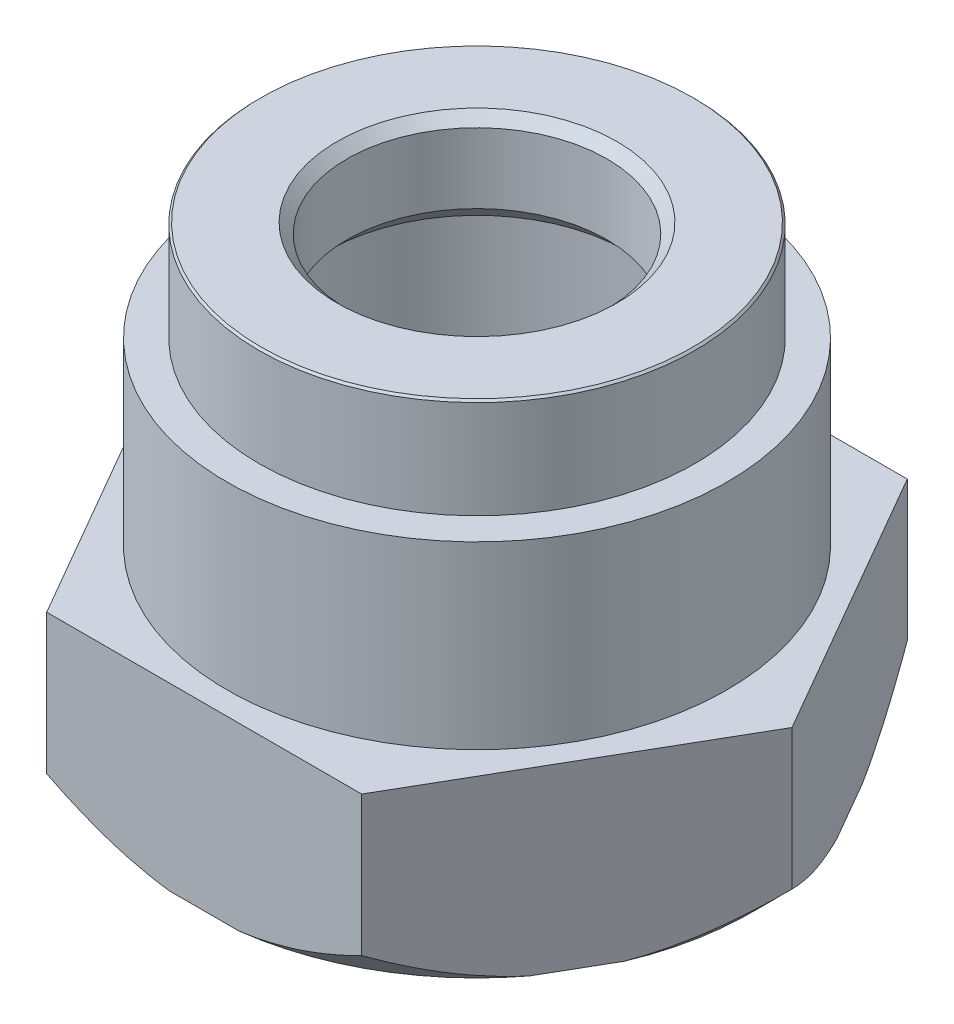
ISO-10303-21;
HEADER;
FILE_DESCRIPTION(('STEP AP214'),'2;1');
FILE_NAME('part.step','',(''),(''),'','','');
FILE_SCHEMA(('AUTOMOTIVE_DESIGN { 1 0 10303 214 1 1 1 1 }'));
ENDSEC;
DATA;
#1=APPLICATION_CONTEXT('core data for automotive mechanical design processes');
#2=APPLICATION_PROTOCOL_DEFINITION('international standard','automotive_design',2000,#1);
#3=PRODUCT_CONTEXT('',#1,'mechanical');
#4=PRODUCT('Part','Part','',(#3));
#5=PRODUCT_RELATED_PRODUCT_CATEGORY('part','',(#4));
#6=PRODUCT_DEFINITION_FORMATION('','',#4);
#7=PRODUCT_DEFINITION_CONTEXT('part definition',#1,'design');
#8=PRODUCT_DEFINITION('design','',#6,#7);
#9=PRODUCT_DEFINITION_SHAPE('','',#8);
#10=(LENGTH_UNIT() NAMED_UNIT(*) SI_UNIT(.MILLI.,.METRE.));
#11=(NAMED_UNIT(*) PLANE_ANGLE_UNIT() SI_UNIT($,.RADIAN.));
#12=(NAMED_UNIT(*) SI_UNIT($,.STERADIAN.) SOLID_ANGLE_UNIT());
#13=UNCERTAINTY_MEASURE_WITH_UNIT(LENGTH_MEASURE(1.E-05),#10,'distance_accuracy_value','');
#14=(GEOMETRIC_REPRESENTATION_CONTEXT(3) GLOBAL_UNCERTAINTY_ASSIGNED_CONTEXT((#13)) GLOBAL_UNIT_ASSIGNED_CONTEXT((#10,
#11,#12)) REPRESENTATION_CONTEXT('',''));
#15=CARTESIAN_POINT('',(0.,0.,0.));
#16=DIRECTION('',(0.,0.,1.));
#17=DIRECTION('',(1.,0.,0.));
#18=AXIS2_PLACEMENT_3D('',#15,#16,#17);
#19=CARTESIAN_POINT('',(15.75,0.,0.));
#20=DIRECTION('',(0.,-1.,0.));
#21=DIRECTION('',(0.,0.,-1.));
#22=AXIS2_PLACEMENT_3D('',#19,#20,#21);
#23=PLANE('',#22);
#24=CARTESIAN_POINT('',(0.,0.,0.));
#25=DIRECTION('',(0.,-1.,0.));
#26=DIRECTION('',(0.,0.,-1.));
#27=AXIS2_PLACEMENT_3D('',#24,#25,#26);
#28=CIRCLE('',#27,10.3155);
#29=CARTESIAN_POINT('',(0.,0.,-10.3155));
#30=VERTEX_POINT('',#29);
#31=EDGE_CURVE('E284',#30,#30,#28,.T.);
#32=ORIENTED_EDGE('',*,*,#31,.F.);
#33=EDGE_LOOP('',(#32));
#34=FACE_BOUND('',#33,.T.);
#35=CARTESIAN_POINT('',(0.,0.,0.));
#36=DIRECTION('',(0.,-1.,0.));
#37=DIRECTION('',(0.,0.,-1.));
#38=AXIS2_PLACEMENT_3D('',#35,#36,#37);
#39=CIRCLE('',#38,13.75);
#40=CARTESIAN_POINT('',(12.6807777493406,0.,-5.31604887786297));
#41=VERTEX_POINT('',#40);
#42=CARTESIAN_POINT('',(12.6807777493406,0.,5.31604887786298));
#43=VERTEX_POINT('',#42);
#44=EDGE_CURVE('E150',#41,#43,#39,.T.);
#45=ORIENTED_EDGE('',*,*,#44,.T.);
#46=DIRECTION('',(-0.5,0.,0.866025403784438));
#47=VECTOR('',#46,1.);
#48=CARTESIAN_POINT('',(15.75,0.,0.));
#49=LINE('',#48,#47);
#50=CARTESIAN_POINT('',(10.9442222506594,0.,8.32385123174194));
#51=VERTEX_POINT('',#50);
#52=EDGE_CURVE('E139',#43,#51,#49,.T.);
#53=ORIENTED_EDGE('',*,*,#52,.T.);
#54=CARTESIAN_POINT('',(1.73655549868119,0.,13.6399001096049));
#55=VERTEX_POINT('',#54);
#56=EDGE_CURVE('E145',#51,#55,#39,.T.);
#57=ORIENTED_EDGE('',*,*,#56,.T.);
#58=DIRECTION('',(-1.,0.,0.));
#59=VECTOR('',#58,1.);
#60=CARTESIAN_POINT('',(7.87499999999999,0.,13.6399001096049));
#61=LINE('',#60,#59);
#62=CARTESIAN_POINT('',(-1.7365554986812,0.,13.6399001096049));
#63=VERTEX_POINT('',#62);
#64=EDGE_CURVE('E128',#55,#63,#61,.T.);
#65=ORIENTED_EDGE('',*,*,#64,.T.);
#66=CARTESIAN_POINT('',(-10.9442222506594,0.,8.32385123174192));
#67=VERTEX_POINT('',#66);
#68=EDGE_CURVE('E151',#63,#67,#39,.T.);
#69=ORIENTED_EDGE('',*,*,#68,.T.);
#70=DIRECTION('',(-0.5,0.,-0.866025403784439));
#71=VECTOR('',#70,1.);
#72=CARTESIAN_POINT('',(-7.875,0.,13.6399001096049));
#73=LINE('',#72,#71);
#74=CARTESIAN_POINT('',(-12.6807777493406,0.,5.316048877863));
#75=VERTEX_POINT('',#74);
#76=EDGE_CURVE('E138',#67,#75,#73,.T.);
#77=ORIENTED_EDGE('',*,*,#76,.T.);
#78=CARTESIAN_POINT('',(-12.6807777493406,0.,-5.31604887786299));
#79=VERTEX_POINT('',#78);
#80=EDGE_CURVE('E154',#75,#79,#39,.T.);
#81=ORIENTED_EDGE('',*,*,#80,.T.);
#82=DIRECTION('',(0.5,0.,-0.866025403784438));
#83=VECTOR('',#82,1.);
#84=CARTESIAN_POINT('',(-15.75,0.,0.));
#85=LINE('',#84,#83);
#86=CARTESIAN_POINT('',(-10.9442222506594,0.,-8.32385123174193));
#87=VERTEX_POINT('',#86);
#88=EDGE_CURVE('E311',#79,#87,#85,.T.);
#89=ORIENTED_EDGE('',*,*,#88,.T.);
#90=CARTESIAN_POINT('',(-1.73655549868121,0.,-13.6399001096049));
#91=VERTEX_POINT('',#90);
#92=EDGE_CURVE('E157',#87,#91,#39,.T.);
#93=ORIENTED_EDGE('',*,*,#92,.T.);
#94=DIRECTION('',(1.,0.,0.));
#95=VECTOR('',#94,1.);
#96=CARTESIAN_POINT('',(-7.875,0.,-13.6399001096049));
#97=LINE('',#96,#95);
#98=CARTESIAN_POINT('',(1.73655549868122,0.,-13.6399001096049));
#99=VERTEX_POINT('',#98);
#100=EDGE_CURVE('E351',#91,#99,#97,.T.);
#101=ORIENTED_EDGE('',*,*,#100,.T.);
#102=CARTESIAN_POINT('',(10.9442222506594,0.,-8.32385123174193));
#103=VERTEX_POINT('',#102);
#104=EDGE_CURVE('E153',#99,#103,#39,.T.);
#105=ORIENTED_EDGE('',*,*,#104,.T.);
#106=DIRECTION('',(0.5,0.,0.866025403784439));
#107=VECTOR('',#106,1.);
#108=CARTESIAN_POINT('',(7.875,0.,-13.6399001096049));
#109=LINE('',#108,#107);
#110=EDGE_CURVE('E331',#103,#41,#109,.T.);
#111=ORIENTED_EDGE('',*,*,#110,.T.);
#112=EDGE_LOOP('',(#45,#53,#57,#65,#69,#77,#81,#89,#93,#101,#105,#111));
#113=FACE_BOUND('',#112,.T.);
#114=ADVANCED_FACE('F34',(#34,#113),#23,.T.);
#115=CARTESIAN_POINT('',(12.5,9.,0.));
#116=DIRECTION('',(0.,1.,0.));
#117=DIRECTION('',(0.,0.,1.));
#118=AXIS2_PLACEMENT_3D('',#115,#116,#117);
#119=PLANE('',#118);
#120=CARTESIAN_POINT('',(0.,9.,0.));
#121=DIRECTION('',(0.,-1.,0.));
#122=DIRECTION('',(0.,0.,-1.));
#123=AXIS2_PLACEMENT_3D('',#120,#121,#122);
#124=CIRCLE('',#123,12.5);
#125=CARTESIAN_POINT('',(0.,9.,-12.5));
#126=VERTEX_POINT('',#125);
#127=EDGE_CURVE('E281',#126,#126,#124,.T.);
#128=ORIENTED_EDGE('',*,*,#127,.T.);
#129=EDGE_LOOP('',(#128));
#130=FACE_BOUND('',#129,.T.);
#131=DIRECTION('',(1.,0.,0.));
#132=VECTOR('',#131,1.);
#133=CARTESIAN_POINT('',(12.5,9.,13.6399001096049));
#134=LINE('',#133,#132);
#135=CARTESIAN_POINT('',(-7.875,9.,13.6399001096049));
#136=VERTEX_POINT('',#135);
#137=CARTESIAN_POINT('',(7.87499999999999,8.99999999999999,13.6399001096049));
#138=VERTEX_POINT('',#137);
#139=EDGE_CURVE('E332',#136,#138,#134,.T.);
#140=ORIENTED_EDGE('',*,*,#139,.T.);
#141=DIRECTION('',(0.5,0.,-0.866025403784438));
#142=VECTOR('',#141,1.);
#143=CARTESIAN_POINT('',(14.9375,9.,1.40729128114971));
#144=LINE('',#143,#142);
#145=CARTESIAN_POINT('',(15.75,9.,0.));
#146=VERTEX_POINT('',#145);
#147=EDGE_CURVE('E269',#138,#146,#144,.T.);
#148=ORIENTED_EDGE('',*,*,#147,.T.);
#149=DIRECTION('',(-0.5,0.,-0.866025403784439));
#150=VECTOR('',#149,1.);
#151=CARTESIAN_POINT('',(14.9375,9.,-1.40729128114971));
#152=LINE('',#151,#150);
#153=CARTESIAN_POINT('',(7.875,9.,-13.6399001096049));
#154=VERTEX_POINT('',#153);
#155=EDGE_CURVE('E275',#146,#154,#152,.T.);
#156=ORIENTED_EDGE('',*,*,#155,.T.);
#157=DIRECTION('',(-1.,0.,0.));
#158=VECTOR('',#157,1.);
#159=CARTESIAN_POINT('',(12.5,9.,-13.6399001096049));
#160=LINE('',#159,#158);
#161=CARTESIAN_POINT('',(-7.875,9.,-13.6399001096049));
#162=VERTEX_POINT('',#161);
#163=EDGE_CURVE('E339',#154,#162,#160,.T.);
#164=ORIENTED_EDGE('',*,*,#163,.T.);
#165=DIRECTION('',(-0.5,0.,0.866025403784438));
#166=VECTOR('',#165,1.);
#167=CARTESIAN_POINT('',(-8.6875,9.,-12.2326088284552));
#168=LINE('',#167,#166);
#169=CARTESIAN_POINT('',(-15.75,9.,0.));
#170=VERTEX_POINT('',#169);
#171=EDGE_CURVE('E337',#162,#170,#168,.T.);
#172=ORIENTED_EDGE('',*,*,#171,.T.);
#173=DIRECTION('',(0.5,0.,0.866025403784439));
#174=VECTOR('',#173,1.);
#175=CARTESIAN_POINT('',(-8.6875,9.,12.2326088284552));
#176=LINE('',#175,#174);
#177=EDGE_CURVE('E322',#170,#136,#176,.T.);
#178=ORIENTED_EDGE('',*,*,#177,.T.);
#179=EDGE_LOOP('',(#140,#148,#156,#164,#172,#178));
#180=FACE_BOUND('',#179,.T.);
#181=ADVANCED_FACE('F214',(#130,#180),#119,.T.);
#182=CARTESIAN_POINT('',(0.,0.,0.));
#183=DIRECTION('',(0.,1.,0.));
#184=DIRECTION('',(0.,0.,1.));
#185=AXIS2_PLACEMENT_3D('',#182,#183,#184);
#186=CONICAL_SURFACE('',#185,13.75,0.785398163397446);
#187=CARTESIAN_POINT('',(2.37511180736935,9.53742275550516,-23.1659858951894));
#188=CARTESIAN_POINT('',(2.56170228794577,9.2349899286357,-22.8428017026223));
#189=CARTESIAN_POINT('',(2.74903266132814,8.9343665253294,-22.5183359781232));
#190=CARTESIAN_POINT('',(3.12542944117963,8.33743132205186,-21.8663976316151));
#191=CARTESIAN_POINT('',(3.31449600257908,8.04111991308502,-21.5389247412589));
#192=CARTESIAN_POINT('',(3.69503746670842,7.45286120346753,-20.8798075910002));
#193=CARTESIAN_POINT('',(3.88651700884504,7.16092588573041,-20.5481552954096));
#194=CARTESIAN_POINT('',(4.27173427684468,6.58308899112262,-19.8809394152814));
#195=CARTESIAN_POINT('',(4.46547194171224,6.29718725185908,-19.545375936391));
#196=CARTESIAN_POINT('',(4.86093215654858,5.72479172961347,-18.8604187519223));
#197=CARTESIAN_POINT('',(5.06272759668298,5.4384988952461,-18.5108987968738));
#198=CARTESIAN_POINT('',(5.46952163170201,4.87509642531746,-17.8063108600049));
#199=CARTESIAN_POINT('',(5.67452037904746,4.5979872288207,-17.4512426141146));
#200=CARTESIAN_POINT('',(6.08803907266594,4.05526273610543,-16.7350072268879));
#201=CARTESIAN_POINT('',(6.29655571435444,3.78963740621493,-16.3738458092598));
#202=CARTESIAN_POINT('',(6.71784155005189,3.27229340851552,-15.6441573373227));
#203=CARTESIAN_POINT('',(6.93061020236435,3.02057298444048,-15.2756312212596));
#204=CARTESIAN_POINT('',(7.36654342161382,2.52821349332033,-14.5205727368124));
#205=CARTESIAN_POINT('',(7.58983473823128,2.28802032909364,-14.133820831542));
#206=CARTESIAN_POINT('',(8.04229307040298,1.83051100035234,-13.3501400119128));
#207=CARTESIAN_POINT('',(8.27146091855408,1.61319810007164,-12.9532096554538));
#208=CARTESIAN_POINT('',(8.7349217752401,1.20860716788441,-12.1504719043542));
#209=CARTESIAN_POINT('',(8.9691803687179,1.02117307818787,-11.7447241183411));
#210=CARTESIAN_POINT('',(9.44413012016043,0.682154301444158,-10.9220870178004));
#211=CARTESIAN_POINT('',(9.68481931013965,0.530558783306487,-10.5052011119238));
#212=CARTESIAN_POINT('',(10.1243832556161,0.296464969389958,-9.74385402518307));
#213=CARTESIAN_POINT('',(10.3222249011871,0.206250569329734,-9.40118224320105));
#214=CARTESIAN_POINT('',(10.7209154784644,0.0579619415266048,-8.7106299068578));
#215=CARTESIAN_POINT('',(10.921763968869,-0.000116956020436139,-8.36275011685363));
#216=CARTESIAN_POINT('',(11.32489123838,-0.0811515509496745,-7.66451320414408));
#217=CARTESIAN_POINT('',(11.5271668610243,-0.104169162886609,-7.31416154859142));
#218=CARTESIAN_POINT('',(11.9319444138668,-0.114013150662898,-6.61306626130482));
#219=CARTESIAN_POINT('',(12.1344463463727,-0.100839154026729,-6.26232262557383));
#220=CARTESIAN_POINT('',(12.5375538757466,-0.0391108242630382,-5.56411990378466));
#221=CARTESIAN_POINT('',(12.7381630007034,0.00935282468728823,-5.21665470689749));
#222=CARTESIAN_POINT('',(13.136691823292,0.1390628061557,-4.52638253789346));
#223=CARTESIAN_POINT('',(13.3346112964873,0.220311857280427,-4.18357595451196));
#224=CARTESIAN_POINT('',(13.7274412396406,0.412246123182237,-3.50317453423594));
#225=CARTESIAN_POINT('',(13.9223407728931,0.523019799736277,-3.16559864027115));
#226=CARTESIAN_POINT('',(14.3080471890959,0.769789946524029,-2.4975355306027));
#227=CARTESIAN_POINT('',(14.4988542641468,0.905785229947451,-2.16704798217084));
#228=CARTESIAN_POINT('',(14.9434097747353,1.25115914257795,-1.39705525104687));
#229=CARTESIAN_POINT('',(15.1954225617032,1.46943937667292,-0.960556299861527));
#230=CARTESIAN_POINT('',(15.6923360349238,1.93651716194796,-0.099876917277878));
#231=CARTESIAN_POINT('',(15.9372326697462,2.18533169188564,0.324296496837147));
#232=CARTESIAN_POINT('',(16.4211035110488,2.70713877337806,1.16238537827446));
#233=CARTESIAN_POINT('',(16.660064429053,2.98018023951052,1.5762778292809));
#234=CARTESIAN_POINT('',(17.13237131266,3.54472972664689,2.39433734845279));
#235=CARTESIAN_POINT('',(17.3657182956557,3.83623436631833,2.79850617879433));
#236=CARTESIAN_POINT('',(17.8287414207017,4.43522199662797,3.60048575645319));
#237=CARTESIAN_POINT('',(18.0583955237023,4.74277281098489,3.99825833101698));
#238=CARTESIAN_POINT('',(18.5136574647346,5.36962174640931,4.78679514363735));
#239=CARTESIAN_POINT('',(18.7392651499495,5.68892030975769,5.17755911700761));
#240=CARTESIAN_POINT('',(19.1868114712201,6.33664951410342,5.95273208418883));
#241=CARTESIAN_POINT('',(19.4087536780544,6.66507031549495,6.33714726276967));
#242=CARTESIAN_POINT('',(19.8497185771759,7.32961993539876,7.10092087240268));
#243=CARTESIAN_POINT('',(20.068741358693,7.66574851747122,7.48027945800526));
#244=CARTESIAN_POINT('',(20.3676103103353,8.13141274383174,7.99793566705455));
#245=CARTESIAN_POINT('',(20.4485300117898,8.25820385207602,8.13809270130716));
#246=CARTESIAN_POINT('',(20.6100480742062,8.51262265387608,8.41785019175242));
#247=CARTESIAN_POINT('',(20.690646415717,8.64025039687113,8.55745061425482));
#248=CARTESIAN_POINT('',(20.85118722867,8.89572645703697,8.83551545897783));
#249=CARTESIAN_POINT('',(20.9311310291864,9.02357143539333,8.97398218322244));
#250=CARTESIAN_POINT('',(21.0907247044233,9.27997322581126,9.25040653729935));
#251=CARTESIAN_POINT('',(21.1703745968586,9.40852999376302,9.38836419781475));
#252=CARTESIAN_POINT('',(21.2498881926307,9.53742275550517,9.52608578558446));
#253=B_SPLINE_CURVE_WITH_KNOTS('',3,(#187,#188,#189,#190,#191,#192,#193,#194,#195,#196,#197,
#198,#199,#200,#201,#202,#203,#204,#205,#206,#207,#208,#209,#210,#211,#212,#213,#214,#215,#216,
#217,#218,#219,#220,#221,#222,#223,#224,#225,#226,#227,#228,#229,#230,#231,#232,#233,#234,#235,
#236,#237,#238,#239,#240,#241,#242,#243,#244,#245,#246,#247,#248,#249,#250,#251,#252),
.UNSPECIFIED.,.F.,.F.,(4,2,2,2,2,2,2,2,2,2,2,2,2,2,2,2,2,2,2,2,2,2,2,2,2,2,2,2,2,2,2,2,4),(0.,
1.44103956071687,2.88220898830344,4.32678789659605,5.77132787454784,7.25568962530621,
8.7401222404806,10.2232305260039,11.7061510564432,13.2268641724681,14.7477939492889,
16.26049936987,17.7727470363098,18.9891008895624,20.2052779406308,21.4193048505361,
22.6333442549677,23.8442748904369,25.0553059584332,26.2700071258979,27.4846511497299,
29.1310519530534,30.7783724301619,32.4290980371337,34.079522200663,35.7375993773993,
37.3957390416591,39.0521547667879,40.7085197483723,41.3252935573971,41.9421041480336,
42.5562482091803,43.1703546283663),.UNSPECIFIED.);
#254=CARTESIAN_POINT('',(15.75,2.00000000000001,0.));
#255=VERTEX_POINT('',#254);
#256=EDGE_CURVE('E48',#41,#255,#253,.T.);
#257=ORIENTED_EDGE('',*,*,#256,.T.);
#258=CARTESIAN_POINT('',(21.2498881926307,9.53742275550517,-9.52608578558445));
#259=CARTESIAN_POINT('',(21.0632977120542,9.2349899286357,-9.20290159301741));
#260=CARTESIAN_POINT('',(20.8759673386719,8.93436652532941,-8.87843586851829));
#261=CARTESIAN_POINT('',(20.4995705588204,8.33743132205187,-8.2264975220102));
#262=CARTESIAN_POINT('',(20.3105039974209,8.04111991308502,-7.89902463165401));
#263=CARTESIAN_POINT('',(19.9299625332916,7.45286120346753,-7.23990748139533));
#264=CARTESIAN_POINT('',(19.738482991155,7.16092588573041,-6.90825518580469));
#265=CARTESIAN_POINT('',(19.3532657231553,6.58308899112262,-6.24103930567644));
#266=CARTESIAN_POINT('',(19.1595280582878,6.29718725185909,-5.90547582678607));
#267=CARTESIAN_POINT('',(18.7640678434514,5.72479172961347,-5.22051864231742));
#268=CARTESIAN_POINT('',(18.562272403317,5.43849889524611,-4.87099868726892));
#269=CARTESIAN_POINT('',(18.155478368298,4.87509642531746,-4.1664107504));
#270=CARTESIAN_POINT('',(17.9504796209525,4.59798722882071,-3.8113425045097));
#271=CARTESIAN_POINT('',(17.5369609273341,4.05526273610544,-3.09510711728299));
#272=CARTESIAN_POINT('',(17.3284442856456,3.78963740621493,-2.73394569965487));
#273=CARTESIAN_POINT('',(16.9071584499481,3.27229340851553,-2.00425722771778));
#274=CARTESIAN_POINT('',(16.6943897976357,3.02057298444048,-1.63573111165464));
#275=CARTESIAN_POINT('',(16.2584565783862,2.52821349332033,-0.880672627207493));
#276=CARTESIAN_POINT('',(16.0351652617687,2.28802032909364,-0.493920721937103));
#277=CARTESIAN_POINT('',(15.582706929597,1.83051100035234,0.289760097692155));
#278=CARTESIAN_POINT('',(15.3535390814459,1.61319810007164,0.686690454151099));
#279=CARTESIAN_POINT('',(14.8900782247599,1.20860716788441,1.48942820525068));
#280=CARTESIAN_POINT('',(14.6558196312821,1.02117307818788,1.89517599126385));
#281=CARTESIAN_POINT('',(14.1808698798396,0.682154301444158,2.71781309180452));
#282=CARTESIAN_POINT('',(13.9401806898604,0.530558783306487,3.13469899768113));
#283=CARTESIAN_POINT('',(13.5006167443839,0.296464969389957,3.89604608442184));
#284=CARTESIAN_POINT('',(13.3027750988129,0.206250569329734,4.23871786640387));
#285=CARTESIAN_POINT('',(12.9040845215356,0.0579619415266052,4.92927020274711));
#286=CARTESIAN_POINT('',(12.703236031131,-0.000116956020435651,5.27714999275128));
#287=CARTESIAN_POINT('',(12.30010876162,-0.0811515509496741,5.97538690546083));
#288=CARTESIAN_POINT('',(12.0978331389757,-0.104169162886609,6.32573856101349));
#289=CARTESIAN_POINT('',(11.6930555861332,-0.114013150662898,7.0268338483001));
#290=CARTESIAN_POINT('',(11.4905536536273,-0.100839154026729,7.37757748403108));
#291=CARTESIAN_POINT('',(11.0874461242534,-0.0391108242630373,8.07578020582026));
#292=CARTESIAN_POINT('',(10.8868369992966,0.00935282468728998,8.42324540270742));
#293=CARTESIAN_POINT('',(10.488308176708,0.139062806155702,9.11351757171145));
#294=CARTESIAN_POINT('',(10.2903887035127,0.220311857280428,9.45632415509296));
#295=CARTESIAN_POINT('',(9.89755876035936,0.412246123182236,10.136725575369));
#296=CARTESIAN_POINT('',(9.70265922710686,0.523019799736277,10.4743014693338));
#297=CARTESIAN_POINT('',(9.31695281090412,0.76978994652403,11.1423645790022));
#298=CARTESIAN_POINT('',(9.12614573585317,0.905785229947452,11.4728521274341));
#299=CARTESIAN_POINT('',(8.68159022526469,1.25115914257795,12.242844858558));
#300=CARTESIAN_POINT('',(8.42957743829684,1.46943937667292,12.6793438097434));
#301=CARTESIAN_POINT('',(7.93266396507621,1.93651716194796,13.540023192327));
#302=CARTESIAN_POINT('',(7.68776733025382,2.18533169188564,13.9641966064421));
#303=CARTESIAN_POINT('',(7.20389648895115,2.70713877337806,14.8022854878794));
#304=CARTESIAN_POINT('',(6.96493557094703,2.98018023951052,15.2161779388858));
#305=CARTESIAN_POINT('',(6.49262868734,3.54472972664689,16.0342374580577));
#306=CARTESIAN_POINT('',(6.25928170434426,3.83623436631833,16.4384062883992));
#307=CARTESIAN_POINT('',(5.79625857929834,4.43522199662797,17.2403858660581));
#308=CARTESIAN_POINT('',(5.56660447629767,4.74277281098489,17.6381584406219));
#309=CARTESIAN_POINT('',(5.11134253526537,5.36962174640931,18.4266952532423));
#310=CARTESIAN_POINT('',(4.88573485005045,5.68892030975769,18.8174592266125));
#311=CARTESIAN_POINT('',(4.43818852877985,6.33664951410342,19.5926321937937));
#312=CARTESIAN_POINT('',(4.21624632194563,6.66507031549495,19.9770473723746));
#313=CARTESIAN_POINT('',(3.77528142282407,7.32961993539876,20.7408209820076));
#314=CARTESIAN_POINT('',(3.55625864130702,7.66574851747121,21.1201795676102));
#315=CARTESIAN_POINT('',(3.25738968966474,8.13141274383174,21.6378357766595));
#316=CARTESIAN_POINT('',(3.17646998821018,8.25820385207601,21.7779928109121));
#317=CARTESIAN_POINT('',(3.01495192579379,8.51262265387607,22.0577503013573));
#318=CARTESIAN_POINT('',(2.93435358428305,8.64025039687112,22.1973507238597));
#319=CARTESIAN_POINT('',(2.77381277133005,8.89572645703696,22.4754155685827));
#320=CARTESIAN_POINT('',(2.69386897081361,9.02357143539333,22.6138822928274));
#321=CARTESIAN_POINT('',(2.53427529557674,9.27997322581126,22.8903066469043));
#322=CARTESIAN_POINT('',(2.4546254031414,9.40852999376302,23.0282643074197));
#323=CARTESIAN_POINT('',(2.37511180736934,9.53742275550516,23.1659858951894));
#324=B_SPLINE_CURVE_WITH_KNOTS('',3,(#258,#259,#260,#261,#262,#263,#264,#265,#266,#267,#268,
#269,#270,#271,#272,#273,#274,#275,#276,#277,#278,#279,#280,#281,#282,#283,#284,#285,#286,#287,
#288,#289,#290,#291,#292,#293,#294,#295,#296,#297,#298,#299,#300,#301,#302,#303,#304,#305,#306,
#307,#308,#309,#310,#311,#312,#313,#314,#315,#316,#317,#318,#319,#320,#321,#322,#323),
.UNSPECIFIED.,.F.,.F.,(4,2,2,2,2,2,2,2,2,2,2,2,2,2,2,2,2,2,2,2,2,2,2,2,2,2,2,2,2,2,2,2,4),(0.,
1.44103956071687,2.88220898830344,4.32678789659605,5.77132787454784,7.25568962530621,
8.7401222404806,10.223230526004,11.7061510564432,13.2268641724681,14.7477939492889,
16.26049936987,17.7727470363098,18.9891008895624,20.2052779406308,21.4193048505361,
22.6333442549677,23.8442748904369,25.0553059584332,26.2700071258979,27.4846511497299,
29.1310519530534,30.7783724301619,32.4290980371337,34.079522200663,35.7375993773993,
37.3957390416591,39.052154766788,40.7085197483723,41.3252935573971,41.9421041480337,
42.5562482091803,43.1703546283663),.UNSPECIFIED.);
#325=EDGE_CURVE('E13',#255,#43,#324,.T.);
#326=ORIENTED_EDGE('',*,*,#325,.T.);
#327=ORIENTED_EDGE('',*,*,#44,.F.);
#328=EDGE_LOOP('',(#257,#326,#327));
#329=FACE_BOUND('',#328,.T.);
#330=ADVANCED_FACE('F36',(#329),#186,.T.);
#331=CARTESIAN_POINT('',(-17.4010857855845,8.35983178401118,-13.6399001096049));
#332=CARTESIAN_POINT('',(-17.0112696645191,8.05308939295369,-13.6399001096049));
#333=CARTESIAN_POINT('',(-16.619583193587,7.74869347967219,-13.6399001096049));
#334=CARTESIAN_POINT('',(-15.8317463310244,7.14560198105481,-13.6399001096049));
#335=CARTESIAN_POINT('',(-15.4355952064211,6.84690735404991,-13.6399001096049));
#336=CARTESIAN_POINT('',(-14.636225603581,6.254840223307,-13.6399001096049));
#337=CARTESIAN_POINT('',(-14.2329815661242,5.96150213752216,-13.6399001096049));
#338=CARTESIAN_POINT('',(-13.4205835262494,5.38315209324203,-13.6399001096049));
#339=CARTESIAN_POINT('',(-13.0114298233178,5.0981397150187,-13.6399001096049));
#340=CARTESIAN_POINT('',(-12.1658623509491,4.5244048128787,-13.6399001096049));
#341=CARTESIAN_POINT('',(-11.7291000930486,4.23619393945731,-13.6399001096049));
#342=CARTESIAN_POINT('',(-10.8466587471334,3.6735841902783,-13.6399001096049));
#343=CARTESIAN_POINT('',(-10.4009786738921,3.39918685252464,-13.6399001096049));
#344=CARTESIAN_POINT('',(-9.50019231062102,2.86831388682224,-13.6399001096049));
#345=CARTESIAN_POINT('',(-9.04510629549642,2.61180405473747,-13.6399001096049));
#346=CARTESIAN_POINT('',(-8.12327821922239,2.12080252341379,-13.6399001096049));
#347=CARTESIAN_POINT('',(-7.65653975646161,1.88630413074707,-13.6399001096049));
#348=CARTESIAN_POINT('',(-6.75888800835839,1.46803369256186,-13.6399001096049));
#349=CARTESIAN_POINT('',(-6.3292597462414,1.2815237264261,-13.6399001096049));
#350=CARTESIAN_POINT('',(-5.45881218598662,0.936251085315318,-13.6399001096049));
#351=CARTESIAN_POINT('',(-5.01799181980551,0.777491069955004,-13.6399001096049));
#352=CARTESIAN_POINT('',(-4.13058465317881,0.49548107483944,-13.6399001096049));
#353=CARTESIAN_POINT('',(-3.68412218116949,0.371844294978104,-13.6399001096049));
#354=CARTESIAN_POINT('',(-2.78196633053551,0.163808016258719,-13.6399001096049));
#355=CARTESIAN_POINT('',(-2.32627414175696,0.079403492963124,-13.6399001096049));
#356=CARTESIAN_POINT('',(-1.63403672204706,-0.0145292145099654,-13.6399001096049));
#357=CARTESIAN_POINT('',(-1.39964150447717,-0.0404771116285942,-13.6399001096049));
#358=CARTESIAN_POINT('',(-0.929815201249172,-0.08044568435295,-13.6399001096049));
#359=CARTESIAN_POINT('',(-0.694384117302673,-0.0944663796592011,-13.6399001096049));
#360=CARTESIAN_POINT('',(-0.223131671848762,-0.110308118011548,-13.6399001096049));
#361=CARTESIAN_POINT('',(0.0126896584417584,-0.112130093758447,-13.6399001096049));
#362=CARTESIAN_POINT('',(0.48410933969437,-0.103546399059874,-13.6399001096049));
#363=CARTESIAN_POINT('',(0.719707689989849,-0.0931406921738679,-13.6399001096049));
#364=CARTESIAN_POINT('',(1.19074774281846,-0.0602445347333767,-13.6399001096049));
#365=CARTESIAN_POINT('',(1.42618698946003,-0.0377189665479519,-13.6399001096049));
#366=CARTESIAN_POINT('',(1.89566430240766,0.0190252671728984,-13.6399001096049));
#367=CARTESIAN_POINT('',(2.1297021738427,0.0532455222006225,-13.6399001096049));
#368=CARTESIAN_POINT('',(2.82897169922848,0.172618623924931,-13.6399001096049));
#369=CARTESIAN_POINT('',(3.29141074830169,0.274487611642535,-13.6399001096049));
#370=CARTESIAN_POINT('',(4.34656473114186,0.554076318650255,-13.6399001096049));
#371=CARTESIAN_POINT('',(4.93559340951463,0.745489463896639,-13.6399001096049));
#372=CARTESIAN_POINT('',(6.09429038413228,1.1797690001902,-13.6399001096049));
#373=CARTESIAN_POINT('',(6.66394686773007,1.4226661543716,-13.6399001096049));
#374=CARTESIAN_POINT('',(7.78891979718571,1.94921168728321,-13.6399001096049));
#375=CARTESIAN_POINT('',(8.34410089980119,2.2331451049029,-13.6399001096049));
#376=CARTESIAN_POINT('',(9.43802502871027,2.83050798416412,-13.6399001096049));
#377=CARTESIAN_POINT('',(9.97677183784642,3.14393058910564,-13.6399001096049));
#378=CARTESIAN_POINT('',(10.8127905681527,3.6541812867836,-13.6399001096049));
#379=CARTESIAN_POINT('',(11.1147087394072,3.84348732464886,-13.6399001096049));
#380=CARTESIAN_POINT('',(11.7144999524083,4.22841548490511,-13.6399001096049));
#381=CARTESIAN_POINT('',(12.0123729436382,4.42403768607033,-13.6399001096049));
#382=CARTESIAN_POINT('',(12.6045276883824,4.82074829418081,-13.6399001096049));
#383=CARTESIAN_POINT('',(12.8988087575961,5.02183771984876,-13.6399001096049));
#384=CARTESIAN_POINT('',(13.4840982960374,5.42872597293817,-13.6399001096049));
#385=CARTESIAN_POINT('',(13.7751067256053,5.63452485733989,-13.6399001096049));
#386=CARTESIAN_POINT('',(14.3477146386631,6.0455792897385,-13.6399001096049));
#387=CARTESIAN_POINT('',(14.6293791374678,6.25074439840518,-13.6399001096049));
#388=CARTESIAN_POINT('',(15.1901720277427,6.66451425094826,-13.6399001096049));
#389=CARTESIAN_POINT('',(15.4693003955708,6.87311902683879,-13.6399001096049));
#390=CARTESIAN_POINT('',(16.0250684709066,7.29320754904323,-13.6399001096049));
#391=CARTESIAN_POINT('',(16.3017098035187,7.50468914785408,-13.6399001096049));
#392=CARTESIAN_POINT('',(16.8529063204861,7.93033234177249,-13.6399001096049));
#393=CARTESIAN_POINT('',(17.1274615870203,8.1444938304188,-13.6399001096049));
#394=CARTESIAN_POINT('',(17.4010857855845,8.35983178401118,-13.6399001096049));
#395=B_SPLINE_CURVE_WITH_KNOTS('',3,(#331,#332,#333,#334,#335,#336,#337,#338,#339,#340,#341,
#342,#343,#344,#345,#346,#347,#348,#349,#350,#351,#352,#353,#354,#355,#356,#357,#358,#359,#360,
#361,#362,#363,#364,#365,#366,#367,#368,#369,#370,#371,#372,#373,#374,#375,#376,#377,#378,#379,
#380,#381,#382,#383,#384,#385,#386,#387,#388,#389,#390,#391,#392,#393,#394),.UNSPECIFIED.,.F.,
.F.,(4,2,2,2,2,2,2,2,2,2,2,2,2,2,2,2,2,2,2,2,2,2,2,2,2,2,2,2,2,2,2,4),(0.,1.48811416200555,
2.97647629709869,4.47234105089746,5.96813026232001,7.53777467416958,9.10759346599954,
10.6743231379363,12.2405748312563,13.644897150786,15.0493539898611,16.4376846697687,
17.8258374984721,18.5330617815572,19.2402848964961,19.9474539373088,20.6546250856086,
21.3638564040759,22.0731841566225,23.4916854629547,25.3465561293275,27.2025382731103,
29.0720939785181,30.9412160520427,32.0102245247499,33.0792463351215,34.1484687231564,
35.2177040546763,36.2630689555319,37.3084435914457,38.3530765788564,39.3976681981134),.UNSPECIFIED.);
#396=CARTESIAN_POINT('',(7.875,2.00000000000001,-13.6399001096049));
#397=VERTEX_POINT('',#396);
#398=EDGE_CURVE('E361',#99,#397,#395,.T.);
#399=ORIENTED_EDGE('',*,*,#398,.T.);
#400=EDGE_CURVE('E39',#397,#103,#253,.T.);
#401=ORIENTED_EDGE('',*,*,#400,.T.);
#402=ORIENTED_EDGE('',*,*,#104,.F.);
#403=EDGE_LOOP('',(#399,#401,#402));
#404=FACE_BOUND('',#403,.T.);
#405=ADVANCED_FACE('F360',(#404),#186,.T.);
#406=CARTESIAN_POINT('',(-21.2498881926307,9.53742275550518,9.52608578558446));
#407=CARTESIAN_POINT('',(-21.0632977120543,9.23498992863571,9.20290159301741));
#408=CARTESIAN_POINT('',(-20.8759673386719,8.93436652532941,8.8784358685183));
#409=CARTESIAN_POINT('',(-20.4995705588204,8.33743132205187,8.2264975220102));
#410=CARTESIAN_POINT('',(-20.3105039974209,8.04111991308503,7.89902463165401));
#411=CARTESIAN_POINT('',(-19.9299625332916,7.45286120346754,7.23990748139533));
#412=CARTESIAN_POINT('',(-19.738482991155,7.16092588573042,6.9082551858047));
#413=CARTESIAN_POINT('',(-19.3532657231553,6.58308899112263,6.24103930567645));
#414=CARTESIAN_POINT('',(-19.1595280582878,6.2971872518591,5.90547582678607));
#415=CARTESIAN_POINT('',(-18.7640678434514,5.72479172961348,5.22051864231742));
#416=CARTESIAN_POINT('',(-18.562272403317,5.43849889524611,4.87099868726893));
#417=CARTESIAN_POINT('',(-18.155478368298,4.87509642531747,4.1664107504));
#418=CARTESIAN_POINT('',(-17.9504796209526,4.59798722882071,3.81134250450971));
#419=CARTESIAN_POINT('',(-17.5369609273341,4.05526273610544,3.095107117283));
#420=CARTESIAN_POINT('',(-17.3284442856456,3.78963740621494,2.73394569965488));
#421=CARTESIAN_POINT('',(-16.9071584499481,3.27229340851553,2.00425722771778));
#422=CARTESIAN_POINT('',(-16.6943897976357,3.02057298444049,1.63573111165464));
#423=CARTESIAN_POINT('',(-16.2584565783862,2.52821349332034,0.880672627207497));
#424=CARTESIAN_POINT('',(-16.0351652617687,2.28802032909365,0.493920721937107));
#425=CARTESIAN_POINT('',(-15.582706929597,1.83051100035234,-0.289760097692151));
#426=CARTESIAN_POINT('',(-15.3535390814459,1.61319810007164,-0.686690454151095));
#427=CARTESIAN_POINT('',(-14.8900782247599,1.20860716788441,-1.48942820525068));
#428=CARTESIAN_POINT('',(-14.6558196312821,1.02117307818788,-1.89517599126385));
#429=CARTESIAN_POINT('',(-14.1808698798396,0.682154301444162,-2.71781309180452));
#430=CARTESIAN_POINT('',(-13.9401806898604,0.530558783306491,-3.13469899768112));
#431=CARTESIAN_POINT('',(-13.5006167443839,0.29646496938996,-3.89604608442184));
#432=CARTESIAN_POINT('',(-13.3027750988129,0.206250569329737,-4.23871786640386));
#433=CARTESIAN_POINT('',(-12.9040845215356,0.0579619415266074,-4.92927020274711));
#434=CARTESIAN_POINT('',(-12.703236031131,-0.000116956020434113,-5.27714999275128));
#435=CARTESIAN_POINT('',(-12.30010876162,-0.081151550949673,-5.97538690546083));
#436=CARTESIAN_POINT('',(-12.0978331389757,-0.104169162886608,-6.32573856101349));
#437=CARTESIAN_POINT('',(-11.6930555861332,-0.114013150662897,-7.02683384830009));
#438=CARTESIAN_POINT('',(-11.4905536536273,-0.100839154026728,-7.37757748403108));
#439=CARTESIAN_POINT('',(-11.0874461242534,-0.0391108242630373,-8.07578020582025));
#440=CARTESIAN_POINT('',(-10.8868369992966,0.00935282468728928,-8.42324540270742));
#441=CARTESIAN_POINT('',(-10.488308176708,0.139062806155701,-9.11351757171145));
#442=CARTESIAN_POINT('',(-10.2903887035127,0.220311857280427,-9.45632415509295));
#443=CARTESIAN_POINT('',(-9.89755876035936,0.412246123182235,-10.136725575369));
#444=CARTESIAN_POINT('',(-9.70265922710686,0.523019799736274,-10.4743014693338));
#445=CARTESIAN_POINT('',(-9.31695281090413,0.769789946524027,-11.1423645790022));
#446=CARTESIAN_POINT('',(-9.12614573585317,0.905785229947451,-11.4728521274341));
#447=CARTESIAN_POINT('',(-8.68159022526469,1.25115914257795,-12.242844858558));
#448=CARTESIAN_POINT('',(-8.42957743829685,1.46943937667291,-12.6793438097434));
#449=CARTESIAN_POINT('',(-7.93266396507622,1.93651716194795,-13.540023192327));
#450=CARTESIAN_POINT('',(-7.68776733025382,2.18533169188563,-13.964196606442));
#451=CARTESIAN_POINT('',(-7.20389648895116,2.70713877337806,-14.8022854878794));
#452=CARTESIAN_POINT('',(-6.96493557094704,2.98018023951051,-15.2161779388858));
#453=CARTESIAN_POINT('',(-6.49262868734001,3.54472972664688,-16.0342374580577));
#454=CARTESIAN_POINT('',(-6.25928170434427,3.83623436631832,-16.4384062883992));
#455=CARTESIAN_POINT('',(-5.79625857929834,4.43522199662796,-17.2403858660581));
#456=CARTESIAN_POINT('',(-5.56660447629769,4.74277281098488,-17.6381584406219));
#457=CARTESIAN_POINT('',(-5.11134253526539,5.3696217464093,-18.4266952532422));
#458=CARTESIAN_POINT('',(-4.88573485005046,5.68892030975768,-18.8174592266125));
#459=CARTESIAN_POINT('',(-4.43818852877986,6.33664951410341,-19.5926321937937));
#460=CARTESIAN_POINT('',(-4.21624632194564,6.66507031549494,-19.9770473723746));
#461=CARTESIAN_POINT('',(-3.77528142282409,7.32961993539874,-20.7408209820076));
#462=CARTESIAN_POINT('',(-3.55625864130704,7.6657485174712,-21.1201795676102));
#463=CARTESIAN_POINT('',(-3.25738968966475,8.13141274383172,-21.6378357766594));
#464=CARTESIAN_POINT('',(-3.17646998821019,8.258203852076,-21.777992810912));
#465=CARTESIAN_POINT('',(-3.0149519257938,8.51262265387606,-22.0577503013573));
#466=CARTESIAN_POINT('',(-2.93435358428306,8.64025039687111,-22.1973507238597));
#467=CARTESIAN_POINT('',(-2.77381277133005,8.89572645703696,-22.4754155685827));
#468=CARTESIAN_POINT('',(-2.69386897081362,9.02357143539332,-22.6138822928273));
#469=CARTESIAN_POINT('',(-2.53427529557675,9.27997322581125,-22.8903066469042));
#470=CARTESIAN_POINT('',(-2.45462540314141,9.40852999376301,-23.0282643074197));
#471=CARTESIAN_POINT('',(-2.37511180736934,9.53742275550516,-23.1659858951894));
#472=B_SPLINE_CURVE_WITH_KNOTS('',3,(#406,#407,#408,#409,#410,#411,#412,#413,#414,#415,#416,
#417,#418,#419,#420,#421,#422,#423,#424,#425,#426,#427,#428,#429,#430,#431,#432,#433,#434,#435,
#436,#437,#438,#439,#440,#441,#442,#443,#444,#445,#446,#447,#448,#449,#450,#451,#452,#453,#454,
#455,#456,#457,#458,#459,#460,#461,#462,#463,#464,#465,#466,#467,#468,#469,#470,#471),
.UNSPECIFIED.,.F.,.F.,(4,2,2,2,2,2,2,2,2,2,2,2,2,2,2,2,2,2,2,2,2,2,2,2,2,2,2,2,2,2,2,2,4),(0.,
1.44103956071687,2.88220898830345,4.32678789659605,5.77132787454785,7.25568962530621,
8.7401222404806,10.223230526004,11.7061510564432,13.2268641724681,14.7477939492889,
16.26049936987,17.7727470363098,18.9891008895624,20.2052779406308,21.4193048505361,
22.6333442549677,23.8442748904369,25.0553059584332,26.2700071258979,27.4846511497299,
29.1310519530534,30.7783724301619,32.4290980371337,34.079522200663,35.7375993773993,
37.3957390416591,39.0521547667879,40.7085197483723,41.3252935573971,41.9421041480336,
42.5562482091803,43.1703546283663),.UNSPECIFIED.);
#473=CARTESIAN_POINT('',(-7.875,2.00000000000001,-13.6399001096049));
#474=VERTEX_POINT('',#473);
#475=EDGE_CURVE('E193',#87,#474,#472,.T.);
#476=ORIENTED_EDGE('',*,*,#475,.T.);
#477=EDGE_CURVE('E194',#474,#91,#395,.T.);
#478=ORIENTED_EDGE('',*,*,#477,.T.);
#479=ORIENTED_EDGE('',*,*,#92,.F.);
#480=EDGE_LOOP('',(#476,#478,#479));
#481=FACE_BOUND('',#480,.T.);
#482=ADVANCED_FACE('F364',(#481),#186,.T.);
#483=CARTESIAN_POINT('',(-2.37511180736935,9.53742275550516,23.1659858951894));
#484=CARTESIAN_POINT('',(-2.56170228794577,9.23498992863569,22.8428017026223));
#485=CARTESIAN_POINT('',(-2.74903266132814,8.9343665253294,22.5183359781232));
#486=CARTESIAN_POINT('',(-3.12542944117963,8.33743132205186,21.8663976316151));
#487=CARTESIAN_POINT('',(-3.31449600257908,8.04111991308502,21.5389247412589));
#488=CARTESIAN_POINT('',(-3.69503746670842,7.45286120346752,20.8798075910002));
#489=CARTESIAN_POINT('',(-3.88651700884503,7.1609258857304,20.5481552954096));
#490=CARTESIAN_POINT('',(-4.27173427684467,6.58308899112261,19.8809394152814));
#491=CARTESIAN_POINT('',(-4.46547194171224,6.29718725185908,19.545375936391));
#492=CARTESIAN_POINT('',(-4.86093215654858,5.72479172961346,18.8604187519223));
#493=CARTESIAN_POINT('',(-5.06272759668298,5.4384988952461,18.5108987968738));
#494=CARTESIAN_POINT('',(-5.46952163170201,4.87509642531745,17.8063108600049));
#495=CARTESIAN_POINT('',(-5.67452037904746,4.5979872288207,17.4512426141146));
#496=CARTESIAN_POINT('',(-6.08803907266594,4.05526273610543,16.7350072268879));
#497=CARTESIAN_POINT('',(-6.29655571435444,3.78963740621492,16.3738458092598));
#498=CARTESIAN_POINT('',(-6.71784155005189,3.27229340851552,15.6441573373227));
#499=CARTESIAN_POINT('',(-6.93061020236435,3.02057298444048,15.2756312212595));
#500=CARTESIAN_POINT('',(-7.36654342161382,2.52821349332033,14.5205727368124));
#501=CARTESIAN_POINT('',(-7.58983473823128,2.28802032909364,14.133820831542));
#502=CARTESIAN_POINT('',(-8.04229307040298,1.83051100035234,13.3501400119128));
#503=CARTESIAN_POINT('',(-8.27146091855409,1.61319810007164,12.9532096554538));
#504=CARTESIAN_POINT('',(-8.73492177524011,1.2086071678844,12.1504719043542));
#505=CARTESIAN_POINT('',(-8.96918036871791,1.02117307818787,11.7447241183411));
#506=CARTESIAN_POINT('',(-9.44413012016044,0.682154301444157,10.9220870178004));
#507=CARTESIAN_POINT('',(-9.68481931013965,0.530558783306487,10.5052011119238));
#508=CARTESIAN_POINT('',(-10.1243832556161,0.296464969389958,9.74385402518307));
#509=CARTESIAN_POINT('',(-10.3222249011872,0.206250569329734,9.40118224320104));
#510=CARTESIAN_POINT('',(-10.7209154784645,0.0579619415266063,8.7106299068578));
#511=CARTESIAN_POINT('',(-10.921763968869,-0.000116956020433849,8.36275011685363));
#512=CARTESIAN_POINT('',(-11.32489123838,-0.0811515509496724,7.66451320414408));
#513=CARTESIAN_POINT('',(-11.5271668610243,-0.104169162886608,7.31416154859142));
#514=CARTESIAN_POINT('',(-11.9319444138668,-0.114013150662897,6.61306626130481));
#515=CARTESIAN_POINT('',(-12.1344463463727,-0.100839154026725,6.26232262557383));
#516=CARTESIAN_POINT('',(-12.5375538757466,-0.0391108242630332,5.56411990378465));
#517=CARTESIAN_POINT('',(-12.7381630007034,0.00935282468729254,5.21665470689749));
#518=CARTESIAN_POINT('',(-13.136691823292,0.139062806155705,4.52638253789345));
#519=CARTESIAN_POINT('',(-13.3346112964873,0.220311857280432,4.18357595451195));
#520=CARTESIAN_POINT('',(-13.7274412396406,0.412246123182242,3.50317453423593));
#521=CARTESIAN_POINT('',(-13.9223407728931,0.523019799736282,3.16559864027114));
#522=CARTESIAN_POINT('',(-14.3080471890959,0.769789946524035,2.4975355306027));
#523=CARTESIAN_POINT('',(-14.4988542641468,0.905785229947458,2.16704798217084));
#524=CARTESIAN_POINT('',(-14.9434097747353,1.25115914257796,1.39705525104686));
#525=CARTESIAN_POINT('',(-15.1954225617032,1.46943937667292,0.960556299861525));
#526=CARTESIAN_POINT('',(-15.6923360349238,1.93651716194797,0.0998769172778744));
#527=CARTESIAN_POINT('',(-15.9372326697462,2.18533169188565,-0.324296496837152));
#528=CARTESIAN_POINT('',(-16.4211035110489,2.70713877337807,-1.16238537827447));
#529=CARTESIAN_POINT('',(-16.660064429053,2.98018023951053,-1.57627782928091));
#530=CARTESIAN_POINT('',(-17.13237131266,3.5447297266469,-2.3943373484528));
#531=CARTESIAN_POINT('',(-17.3657182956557,3.83623436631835,-2.79850617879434));
#532=CARTESIAN_POINT('',(-17.8287414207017,4.43522199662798,-3.6004857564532));
#533=CARTESIAN_POINT('',(-18.0583955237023,4.74277281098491,-3.998258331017));
#534=CARTESIAN_POINT('',(-18.5136574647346,5.36962174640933,-4.78679514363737));
#535=CARTESIAN_POINT('',(-18.7392651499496,5.68892030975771,-5.17755911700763));
#536=CARTESIAN_POINT('',(-19.1868114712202,6.33664951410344,-5.95273208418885));
#537=CARTESIAN_POINT('',(-19.4087536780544,6.66507031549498,-6.33714726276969));
#538=CARTESIAN_POINT('',(-19.8497185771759,7.32961993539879,-7.1009208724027));
#539=CARTESIAN_POINT('',(-20.068741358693,7.66574851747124,-7.48027945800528));
#540=CARTESIAN_POINT('',(-20.3676103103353,8.13141274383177,-7.99793566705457));
#541=CARTESIAN_POINT('',(-20.4485300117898,8.25820385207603,-8.13809270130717));
#542=CARTESIAN_POINT('',(-20.6100480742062,8.51262265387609,-8.41785019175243));
#543=CARTESIAN_POINT('',(-20.690646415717,8.64025039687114,-8.55745061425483));
#544=CARTESIAN_POINT('',(-20.85118722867,8.89572645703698,-8.83551545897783));
#545=CARTESIAN_POINT('',(-20.9311310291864,9.02357143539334,-8.97398218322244));
#546=CARTESIAN_POINT('',(-21.0907247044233,9.27997322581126,-9.25040653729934));
#547=CARTESIAN_POINT('',(-21.1703745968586,9.40852999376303,-9.38836419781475));
#548=CARTESIAN_POINT('',(-21.2498881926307,9.53742275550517,-9.52608578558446));
#549=B_SPLINE_CURVE_WITH_KNOTS('',3,(#483,#484,#485,#486,#487,#488,#489,#490,#491,#492,#493,
#494,#495,#496,#497,#498,#499,#500,#501,#502,#503,#504,#505,#506,#507,#508,#509,#510,#511,#512,
#513,#514,#515,#516,#517,#518,#519,#520,#521,#522,#523,#524,#525,#526,#527,#528,#529,#530,#531,
#532,#533,#534,#535,#536,#537,#538,#539,#540,#541,#542,#543,#544,#545,#546,#547,#548),
.UNSPECIFIED.,.F.,.F.,(4,2,2,2,2,2,2,2,2,2,2,2,2,2,2,2,2,2,2,2,2,2,2,2,2,2,2,2,2,2,2,2,4),(0.,
1.44103956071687,2.88220898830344,4.32678789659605,5.77132787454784,7.25568962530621,
8.7401222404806,10.223230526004,11.7061510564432,13.2268641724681,14.7477939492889,
16.26049936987,17.7727470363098,18.9891008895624,20.2052779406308,21.4193048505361,
22.6333442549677,23.8442748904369,25.0553059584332,26.2700071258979,27.4846511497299,
29.1310519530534,30.7783724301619,32.4290980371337,34.0795222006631,35.7375993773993,
37.3957390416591,39.052154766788,40.7085197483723,41.3252935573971,41.9421041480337,
42.5562482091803,43.1703546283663),.UNSPECIFIED.);
#550=CARTESIAN_POINT('',(-15.75,2.00000000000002,0.));
#551=VERTEX_POINT('',#550);
#552=EDGE_CURVE('E187',#75,#551,#549,.T.);
#553=ORIENTED_EDGE('',*,*,#552,.T.);
#554=EDGE_CURVE('E188',#551,#79,#472,.T.);
#555=ORIENTED_EDGE('',*,*,#554,.T.);
#556=ORIENTED_EDGE('',*,*,#80,.F.);
#557=EDGE_LOOP('',(#553,#555,#556));
#558=FACE_BOUND('',#557,.T.);
#559=ADVANCED_FACE('F314',(#558),#186,.T.);
#560=ORIENTED_EDGE('',*,*,#56,.F.);
#561=CARTESIAN_POINT('',(7.87499999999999,2.00000000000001,13.6399001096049));
#562=VERTEX_POINT('',#561);
#563=EDGE_CURVE('E50',#51,#562,#324,.T.);
#564=ORIENTED_EDGE('',*,*,#563,.T.);
#565=CARTESIAN_POINT('',(17.4010857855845,8.35983178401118,13.6399001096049));
#566=CARTESIAN_POINT('',(17.0112696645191,8.05308939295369,13.6399001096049));
#567=CARTESIAN_POINT('',(16.619583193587,7.74869347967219,13.6399001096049));
#568=CARTESIAN_POINT('',(15.8317463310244,7.14560198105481,13.6399001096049));
#569=CARTESIAN_POINT('',(15.4355952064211,6.84690735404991,13.6399001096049));
#570=CARTESIAN_POINT('',(14.636225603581,6.254840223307,13.6399001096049));
#571=CARTESIAN_POINT('',(14.2329815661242,5.96150213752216,13.6399001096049));
#572=CARTESIAN_POINT('',(13.4205835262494,5.38315209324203,13.6399001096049));
#573=CARTESIAN_POINT('',(13.0114298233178,5.09813971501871,13.6399001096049));
#574=CARTESIAN_POINT('',(12.1658623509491,4.5244048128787,13.6399001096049));
#575=CARTESIAN_POINT('',(11.7291000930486,4.23619393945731,13.6399001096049));
#576=CARTESIAN_POINT('',(10.8466587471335,3.6735841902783,13.6399001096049));
#577=CARTESIAN_POINT('',(10.4009786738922,3.39918685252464,13.6399001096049));
#578=CARTESIAN_POINT('',(9.50019231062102,2.86831388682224,13.6399001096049));
#579=CARTESIAN_POINT('',(9.04510629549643,2.61180405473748,13.6399001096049));
#580=CARTESIAN_POINT('',(8.1232782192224,2.12080252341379,13.6399001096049));
#581=CARTESIAN_POINT('',(7.65653975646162,1.88630413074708,13.6399001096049));
#582=CARTESIAN_POINT('',(6.7588880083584,1.46803369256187,13.6399001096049));
#583=CARTESIAN_POINT('',(6.32925974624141,1.2815237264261,13.6399001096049));
#584=CARTESIAN_POINT('',(5.45881218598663,0.936251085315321,13.6399001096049));
#585=CARTESIAN_POINT('',(5.01799181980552,0.777491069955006,13.6399001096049));
#586=CARTESIAN_POINT('',(4.13058465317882,0.495481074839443,13.6399001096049));
#587=CARTESIAN_POINT('',(3.68412218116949,0.371844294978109,13.6399001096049));
#588=CARTESIAN_POINT('',(2.78196633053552,0.163808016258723,13.6399001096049));
#589=CARTESIAN_POINT('',(2.32627414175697,0.0794034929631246,13.6399001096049));
#590=CARTESIAN_POINT('',(1.63403672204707,-0.014529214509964,13.6399001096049));
#591=CARTESIAN_POINT('',(1.39964150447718,-0.0404771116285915,13.6399001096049));
#592=CARTESIAN_POINT('',(0.929815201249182,-0.0804456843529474,13.6399001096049));
#593=CARTESIAN_POINT('',(0.694384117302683,-0.0944663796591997,13.6399001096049));
#594=CARTESIAN_POINT('',(0.223131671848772,-0.110308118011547,13.6399001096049));
#595=CARTESIAN_POINT('',(-0.0126896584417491,-0.112130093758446,13.6399001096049));
#596=CARTESIAN_POINT('',(-0.484109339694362,-0.103546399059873,13.6399001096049));
#597=CARTESIAN_POINT('',(-0.719707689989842,-0.0931406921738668,13.6399001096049));
#598=CARTESIAN_POINT('',(-1.19074774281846,-0.0602445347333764,13.6399001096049));
#599=CARTESIAN_POINT('',(-1.42618698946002,-0.0377189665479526,13.6399001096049));
#600=CARTESIAN_POINT('',(-1.89566430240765,0.019025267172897,13.6399001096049));
#601=CARTESIAN_POINT('',(-2.12970217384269,0.0532455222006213,13.6399001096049));
#602=CARTESIAN_POINT('',(-2.82897169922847,0.17261862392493,13.6399001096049));
#603=CARTESIAN_POINT('',(-3.29141074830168,0.274487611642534,13.6399001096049));
#604=CARTESIAN_POINT('',(-4.34656473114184,0.554076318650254,13.6399001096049));
#605=CARTESIAN_POINT('',(-4.93559340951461,0.745489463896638,13.6399001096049));
#606=CARTESIAN_POINT('',(-6.09429038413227,1.17976900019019,13.6399001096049));
#607=CARTESIAN_POINT('',(-6.66394686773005,1.42266615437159,13.6399001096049));
#608=CARTESIAN_POINT('',(-7.7889197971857,1.9492116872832,13.6399001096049));
#609=CARTESIAN_POINT('',(-8.34410089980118,2.23314510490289,13.6399001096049));
#610=CARTESIAN_POINT('',(-9.43802502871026,2.83050798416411,13.6399001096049));
#611=CARTESIAN_POINT('',(-9.9767718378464,3.14393058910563,13.6399001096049));
#612=CARTESIAN_POINT('',(-10.8127905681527,3.65418128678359,13.6399001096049));
#613=CARTESIAN_POINT('',(-11.1147087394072,3.84348732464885,13.6399001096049));
#614=CARTESIAN_POINT('',(-11.7144999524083,4.2284154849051,13.6399001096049));
#615=CARTESIAN_POINT('',(-12.0123729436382,4.42403768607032,13.6399001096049));
#616=CARTESIAN_POINT('',(-12.6045276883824,4.8207482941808,13.6399001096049));
#617=CARTESIAN_POINT('',(-12.8988087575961,5.02183771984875,13.6399001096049));
#618=CARTESIAN_POINT('',(-13.4840982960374,5.42872597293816,13.6399001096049));
#619=CARTESIAN_POINT('',(-13.7751067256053,5.63452485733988,13.6399001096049));
#620=CARTESIAN_POINT('',(-14.3477146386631,6.04557928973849,13.6399001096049));
#621=CARTESIAN_POINT('',(-14.6293791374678,6.25074439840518,13.6399001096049));
#622=CARTESIAN_POINT('',(-15.1901720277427,6.66451425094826,13.6399001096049));
#623=CARTESIAN_POINT('',(-15.4693003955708,6.87311902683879,13.6399001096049));
#624=CARTESIAN_POINT('',(-16.0250684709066,7.29320754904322,13.6399001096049));
#625=CARTESIAN_POINT('',(-16.3017098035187,7.50468914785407,13.6399001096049));
#626=CARTESIAN_POINT('',(-16.8529063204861,7.93033234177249,13.6399001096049));
#627=CARTESIAN_POINT('',(-17.1274615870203,8.14449383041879,13.6399001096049));
#628=CARTESIAN_POINT('',(-17.4010857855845,8.35983178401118,13.6399001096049));
#629=B_SPLINE_CURVE_WITH_KNOTS('',3,(#565,#566,#567,#568,#569,#570,#571,#572,#573,#574,#575,
#576,#577,#578,#579,#580,#581,#582,#583,#584,#585,#586,#587,#588,#589,#590,#591,#592,#593,#594,
#595,#596,#597,#598,#599,#600,#601,#602,#603,#604,#605,#606,#607,#608,#609,#610,#611,#612,#613,
#614,#615,#616,#617,#618,#619,#620,#621,#622,#623,#624,#625,#626,#627,#628),.UNSPECIFIED.,.F.,
.F.,(4,2,2,2,2,2,2,2,2,2,2,2,2,2,2,2,2,2,2,2,2,2,2,2,2,2,2,2,2,2,2,4),(0.,1.48811416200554,
2.97647629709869,4.47234105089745,5.96813026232,7.53777467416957,9.10759346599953,
10.6743231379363,12.2405748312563,13.644897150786,15.0493539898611,16.4376846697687,
17.825837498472,18.5330617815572,19.2402848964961,19.9474539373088,20.6546250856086,
21.3638564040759,22.0731841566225,23.4916854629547,25.3465561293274,27.2025382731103,
29.0720939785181,30.9412160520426,32.0102245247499,33.0792463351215,34.1484687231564,
35.2177040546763,36.2630689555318,37.3084435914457,38.3530765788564,39.3976681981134),.UNSPECIFIED.);
#630=EDGE_CURVE('E131',#562,#55,#629,.T.);
#631=ORIENTED_EDGE('',*,*,#630,.T.);
#632=EDGE_LOOP('',(#560,#564,#631));
#633=FACE_BOUND('',#632,.T.);
#634=ADVANCED_FACE('F144',(#633),#186,.T.);
#635=CARTESIAN_POINT('',(-7.875,2.00000000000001,13.6399001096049));
#636=VERTEX_POINT('',#635);
#637=EDGE_CURVE('E133',#63,#636,#629,.T.);
#638=ORIENTED_EDGE('',*,*,#637,.T.);
#639=EDGE_CURVE('E146',#636,#67,#549,.T.);
#640=ORIENTED_EDGE('',*,*,#639,.T.);
#641=ORIENTED_EDGE('',*,*,#68,.F.);
#642=EDGE_LOOP('',(#638,#640,#641));
#643=FACE_BOUND('',#642,.T.);
#644=ADVANCED_FACE('F255',(#643),#186,.T.);
#645=CARTESIAN_POINT('',(0.,22.9,0.));
#646=DIRECTION('',(0.,-1.,0.));
#647=DIRECTION('',(0.,0.,-1.));
#648=AXIS2_PLACEMENT_3D('',#645,#646,#647);
#649=CONICAL_SURFACE('',#648,10.9,0.78539816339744);
#650=CARTESIAN_POINT('',(0.,23.,0.));
#651=DIRECTION('',(0.,-1.,0.));
#652=DIRECTION('',(0.,0.,-1.));
#653=AXIS2_PLACEMENT_3D('',#650,#651,#652);
#654=CIRCLE('',#653,10.8);
#655=CARTESIAN_POINT('',(0.,23.,-10.8));
#656=VERTEX_POINT('',#655);
#657=EDGE_CURVE('E158',#656,#656,#654,.T.);
#658=ORIENTED_EDGE('',*,*,#657,.T.);
#659=EDGE_LOOP('',(#658));
#660=FACE_BOUND('',#659,.T.);
#661=CARTESIAN_POINT('',(0.,22.9,0.));
#662=DIRECTION('',(0.,-1.,0.));
#663=DIRECTION('',(0.,0.,-1.));
#664=AXIS2_PLACEMENT_3D('',#661,#662,#663);
#665=CIRCLE('',#664,10.9);
#666=CARTESIAN_POINT('',(0.,22.9,-10.9));
#667=VERTEX_POINT('',#666);
#668=EDGE_CURVE('E266',#667,#667,#665,.T.);
#669=ORIENTED_EDGE('',*,*,#668,.F.);
#670=EDGE_LOOP('',(#669));
#671=FACE_BOUND('',#670,.T.);
#672=ADVANCED_FACE('F252',(#660,#671),#649,.T.);
#673=CARTESIAN_POINT('',(7.,23.,0.));
#674=DIRECTION('',(0.,1.,0.));
#675=DIRECTION('',(0.,0.,1.));
#676=AXIS2_PLACEMENT_3D('',#673,#674,#675);
#677=PLANE('',#676);
#678=CARTESIAN_POINT('',(0.,23.,0.));
#679=DIRECTION('',(0.,-1.,0.));
#680=DIRECTION('',(0.,0.,-1.));
#681=AXIS2_PLACEMENT_3D('',#678,#679,#680);
#682=CIRCLE('',#681,7.);
#683=CARTESIAN_POINT('',(0.,23.,-7.));
#684=VERTEX_POINT('',#683);
#685=EDGE_CURVE('E301',#684,#684,#682,.T.);
#686=ORIENTED_EDGE('',*,*,#685,.T.);
#687=EDGE_LOOP('',(#686));
#688=FACE_BOUND('',#687,.T.);
#689=ORIENTED_EDGE('',*,*,#657,.F.);
#690=EDGE_LOOP('',(#689));
#691=FACE_BOUND('',#690,.T.);
#692=ADVANCED_FACE('F249',(#688,#691),#677,.T.);
#693=CARTESIAN_POINT('',(0.,23.,0.));
#694=DIRECTION('',(0.,1.,0.));
#695=DIRECTION('',(0.,0.,1.));
#696=AXIS2_PLACEMENT_3D('',#693,#694,#695);
#697=CONICAL_SURFACE('',#696,7.,0.78539816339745);
#698=CARTESIAN_POINT('',(0.,22.5,0.));
#699=DIRECTION('',(0.,-1.,0.));
#700=DIRECTION('',(0.,0.,-1.));
#701=AXIS2_PLACEMENT_3D('',#698,#699,#700);
#702=CIRCLE('',#701,6.5);
#703=CARTESIAN_POINT('',(0.,22.5,-6.5));
#704=VERTEX_POINT('',#703);
#705=EDGE_CURVE('E299',#704,#704,#702,.T.);
#706=ORIENTED_EDGE('',*,*,#705,.T.);
#707=EDGE_LOOP('',(#706));
#708=FACE_BOUND('',#707,.T.);
#709=ORIENTED_EDGE('',*,*,#685,.F.);
#710=EDGE_LOOP('',(#709));
#711=FACE_BOUND('',#710,.T.);
#712=ADVANCED_FACE('F245',(#708,#711),#697,.F.);
#713=CARTESIAN_POINT('',(0.,0.,0.));
#714=DIRECTION('',(0.,-1.,0.));
#715=DIRECTION('',(0.,0.,-1.));
#716=AXIS2_PLACEMENT_3D('',#713,#714,#715);
#717=CYLINDRICAL_SURFACE('',#716,6.5);
#718=CARTESIAN_POINT('',(0.,19.,0.));
#719=DIRECTION('',(0.,-1.,0.));
#720=DIRECTION('',(0.,0.,-1.));
#721=AXIS2_PLACEMENT_3D('',#718,#719,#720);
#722=CIRCLE('',#721,6.5);
#723=CARTESIAN_POINT('',(0.,19.,-6.5));
#724=VERTEX_POINT('',#723);
#725=EDGE_CURVE('E296',#724,#724,#722,.T.);
#726=ORIENTED_EDGE('',*,*,#725,.T.);
#727=EDGE_LOOP('',(#726));
#728=FACE_BOUND('',#727,.T.);
#729=ORIENTED_EDGE('',*,*,#705,.F.);
#730=EDGE_LOOP('',(#729));
#731=FACE_BOUND('',#730,.T.);
#732=ADVANCED_FACE('F241',(#728,#731),#717,.F.);
#733=CARTESIAN_POINT('',(0.,19.,0.));
#734=DIRECTION('',(0.,-1.,0.));
#735=DIRECTION('',(0.,0.,-1.));
#736=AXIS2_PLACEMENT_3D('',#733,#734,#735);
#737=CONICAL_SURFACE('',#736,6.5,0.785398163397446);
#738=CARTESIAN_POINT('',(0.,18.,0.));
#739=DIRECTION('',(0.,-1.,0.));
#740=DIRECTION('',(0.,0.,-1.));
#741=AXIS2_PLACEMENT_3D('',#738,#739,#740);
#742=CIRCLE('',#741,7.5);
#743=CARTESIAN_POINT('',(0.,18.,-7.5));
#744=VERTEX_POINT('',#743);
#745=EDGE_CURVE('E293',#744,#744,#742,.T.);
#746=ORIENTED_EDGE('',*,*,#745,.T.);
#747=EDGE_LOOP('',(#746));
#748=FACE_BOUND('',#747,.T.);
#749=ORIENTED_EDGE('',*,*,#725,.F.);
#750=EDGE_LOOP('',(#749));
#751=FACE_BOUND('',#750,.T.);
#752=ADVANCED_FACE('F237',(#748,#751),#737,.F.);
#753=CARTESIAN_POINT('',(9.3155,18.,0.));
#754=DIRECTION('',(0.,-1.,0.));
#755=DIRECTION('',(0.,0.,-1.));
#756=AXIS2_PLACEMENT_3D('',#753,#754,#755);
#757=PLANE('',#756);
#758=CARTESIAN_POINT('',(0.,18.,0.));
#759=DIRECTION('',(0.,-1.,0.));
#760=DIRECTION('',(0.,0.,-1.));
#761=AXIS2_PLACEMENT_3D('',#758,#759,#760);
#762=CIRCLE('',#761,9.3155);
#763=CARTESIAN_POINT('',(0.,18.,-9.3155));
#764=VERTEX_POINT('',#763);
#765=EDGE_CURVE('E290',#764,#764,#762,.T.);
#766=ORIENTED_EDGE('',*,*,#765,.T.);
#767=EDGE_LOOP('',(#766));
#768=FACE_BOUND('',#767,.T.);
#769=ORIENTED_EDGE('',*,*,#745,.F.);
#770=EDGE_LOOP('',(#769));
#771=FACE_BOUND('',#770,.T.);
#772=ADVANCED_FACE('F233',(#768,#771),#757,.T.);
#773=CARTESIAN_POINT('',(0.,0.,0.));
#774=DIRECTION('',(0.,-1.,0.));
#775=DIRECTION('',(0.,0.,-1.));
#776=AXIS2_PLACEMENT_3D('',#773,#774,#775);
#777=CYLINDRICAL_SURFACE('',#776,9.3155);
#778=CARTESIAN_POINT('',(0.,1.00000000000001,0.));
#779=DIRECTION('',(0.,-1.,0.));
#780=DIRECTION('',(0.,0.,-1.));
#781=AXIS2_PLACEMENT_3D('',#778,#779,#780);
#782=CIRCLE('',#781,9.3155);
#783=CARTESIAN_POINT('',(0.,1.00000000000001,-9.3155));
#784=VERTEX_POINT('',#783);
#785=EDGE_CURVE('E287',#784,#784,#782,.T.);
#786=ORIENTED_EDGE('',*,*,#785,.T.);
#787=EDGE_LOOP('',(#786));
#788=FACE_BOUND('',#787,.T.);
#789=ORIENTED_EDGE('',*,*,#765,.F.);
#790=EDGE_LOOP('',(#789));
#791=FACE_BOUND('',#790,.T.);
#792=ADVANCED_FACE('F229',(#788,#791),#777,.F.);
#793=CARTESIAN_POINT('',(0.,1.00000000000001,0.));
#794=DIRECTION('',(0.,-1.,0.));
#795=DIRECTION('',(0.,0.,-1.));
#796=AXIS2_PLACEMENT_3D('',#793,#794,#795);
#797=CONICAL_SURFACE('',#796,9.3155,0.785398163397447);
#798=ORIENTED_EDGE('',*,*,#31,.T.);
#799=EDGE_LOOP('',(#798));
#800=FACE_BOUND('',#799,.T.);
#801=ORIENTED_EDGE('',*,*,#785,.F.);
#802=EDGE_LOOP('',(#801));
#803=FACE_BOUND('',#802,.T.);
#804=ADVANCED_FACE('F225',(#800,#803),#797,.F.);
#805=CARTESIAN_POINT('',(0.,0.,0.));
#806=DIRECTION('',(0.,-1.,0.));
#807=DIRECTION('',(0.,0.,-1.));
#808=AXIS2_PLACEMENT_3D('',#805,#806,#807);
#809=CYLINDRICAL_SURFACE('',#808,12.5);
#810=CARTESIAN_POINT('',(0.,18.,0.));
#811=DIRECTION('',(0.,-1.,0.));
#812=DIRECTION('',(0.,0.,-1.));
#813=AXIS2_PLACEMENT_3D('',#810,#811,#812);
#814=CIRCLE('',#813,12.5);
#815=CARTESIAN_POINT('',(0.,18.,-12.5));
#816=VERTEX_POINT('',#815);
#817=EDGE_CURVE('E272',#816,#816,#814,.T.);
#818=ORIENTED_EDGE('',*,*,#817,.T.);
#819=EDGE_LOOP('',(#818));
#820=FACE_BOUND('',#819,.T.);
#821=ORIENTED_EDGE('',*,*,#127,.F.);
#822=EDGE_LOOP('',(#821));
#823=FACE_BOUND('',#822,.T.);
#824=ADVANCED_FACE('F228',(#820,#823),#809,.T.);
#825=CARTESIAN_POINT('',(10.9,18.,0.));
#826=DIRECTION('',(0.,1.,0.));
#827=DIRECTION('',(0.,0.,1.));
#828=AXIS2_PLACEMENT_3D('',#825,#826,#827);
#829=PLANE('',#828);
#830=CARTESIAN_POINT('',(0.,18.,0.));
#831=DIRECTION('',(0.,-1.,0.));
#832=DIRECTION('',(0.,0.,-1.));
#833=AXIS2_PLACEMENT_3D('',#830,#831,#832);
#834=CIRCLE('',#833,10.9);
#835=CARTESIAN_POINT('',(0.,18.,-10.9));
#836=VERTEX_POINT('',#835);
#837=EDGE_CURVE('E268',#836,#836,#834,.T.);
#838=ORIENTED_EDGE('',*,*,#837,.T.);
#839=EDGE_LOOP('',(#838));
#840=FACE_BOUND('',#839,.T.);
#841=ORIENTED_EDGE('',*,*,#817,.F.);
#842=EDGE_LOOP('',(#841));
#843=FACE_BOUND('',#842,.T.);
#844=ADVANCED_FACE('F397',(#840,#843),#829,.T.);
#845=CARTESIAN_POINT('',(0.,0.,0.));
#846=DIRECTION('',(0.,-1.,0.));
#847=DIRECTION('',(0.,0.,-1.));
#848=AXIS2_PLACEMENT_3D('',#845,#846,#847);
#849=CYLINDRICAL_SURFACE('',#848,10.9);
#850=ORIENTED_EDGE('',*,*,#668,.T.);
#851=EDGE_LOOP('',(#850));
#852=FACE_BOUND('',#851,.T.);
#853=ORIENTED_EDGE('',*,*,#837,.F.);
#854=EDGE_LOOP('',(#853));
#855=FACE_BOUND('',#854,.T.);
#856=ADVANCED_FACE('F180',(#852,#855),#849,.T.);
#857=CARTESIAN_POINT('',(15.75,23.,0.));
#858=DIRECTION('',(0.866025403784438,0.,0.5));
#859=DIRECTION('',(0.5,0.,-0.866025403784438));
#860=AXIS2_PLACEMENT_3D('',#857,#858,#859);
#861=PLANE('',#860);
#862=DIRECTION('',(0.,-1.,0.));
#863=VECTOR('',#862,1.);
#864=CARTESIAN_POINT('',(7.87499999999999,23.,13.6399001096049));
#865=LINE('',#864,#863);
#866=EDGE_CURVE('E57',#138,#562,#865,.T.);
#867=ORIENTED_EDGE('',*,*,#866,.T.);
#868=ORIENTED_EDGE('',*,*,#563,.F.);
#869=ORIENTED_EDGE('',*,*,#52,.F.);
#870=ORIENTED_EDGE('',*,*,#325,.F.);
#871=DIRECTION('',(0.,-1.,0.));
#872=VECTOR('',#871,1.);
#873=CARTESIAN_POINT('',(15.75,23.,0.));
#874=LINE('',#873,#872);
#875=EDGE_CURVE('E335',#146,#255,#874,.T.);
#876=ORIENTED_EDGE('',*,*,#875,.F.);
#877=ORIENTED_EDGE('',*,*,#147,.F.);
#878=EDGE_LOOP('',(#867,#868,#869,#870,#876,#877));
#879=FACE_BOUND('',#878,.T.);
#880=ADVANCED_FACE('F175',(#879),#861,.T.);
#881=CARTESIAN_POINT('',(7.875,23.,-13.6399001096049));
#882=DIRECTION('',(0.866025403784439,0.,-0.5));
#883=DIRECTION('',(-0.5,0.,-0.866025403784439));
#884=AXIS2_PLACEMENT_3D('',#881,#882,#883);
#885=PLANE('',#884);
#886=ORIENTED_EDGE('',*,*,#875,.T.);
#887=ORIENTED_EDGE('',*,*,#256,.F.);
#888=ORIENTED_EDGE('',*,*,#110,.F.);
#889=ORIENTED_EDGE('',*,*,#400,.F.);
#890=DIRECTION('',(0.,-1.,0.));
#891=VECTOR('',#890,1.);
#892=CARTESIAN_POINT('',(7.875,23.,-13.6399001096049));
#893=LINE('',#892,#891);
#894=EDGE_CURVE('E325',#154,#397,#893,.T.);
#895=ORIENTED_EDGE('',*,*,#894,.F.);
#896=ORIENTED_EDGE('',*,*,#155,.F.);
#897=EDGE_LOOP('',(#886,#887,#888,#889,#895,#896));
#898=FACE_BOUND('',#897,.T.);
#899=ADVANCED_FACE('F179',(#898),#885,.T.);
#900=CARTESIAN_POINT('',(-7.875,23.,-13.6399001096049));
#901=DIRECTION('',(0.,0.,-1.));
#902=DIRECTION('',(-1.,0.,0.));
#903=AXIS2_PLACEMENT_3D('',#900,#901,#902);
#904=PLANE('',#903);
#905=ORIENTED_EDGE('',*,*,#894,.T.);
#906=ORIENTED_EDGE('',*,*,#398,.F.);
#907=ORIENTED_EDGE('',*,*,#100,.F.);
#908=ORIENTED_EDGE('',*,*,#477,.F.);
#909=DIRECTION('',(0.,-1.,0.));
#910=VECTOR('',#909,1.);
#911=CARTESIAN_POINT('',(-7.875,23.,-13.6399001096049));
#912=LINE('',#911,#910);
#913=EDGE_CURVE('E323',#162,#474,#912,.T.);
#914=ORIENTED_EDGE('',*,*,#913,.F.);
#915=ORIENTED_EDGE('',*,*,#163,.F.);
#916=EDGE_LOOP('',(#905,#906,#907,#908,#914,#915));
#917=FACE_BOUND('',#916,.T.);
#918=ADVANCED_FACE('F202',(#917),#904,.T.);
#919=CARTESIAN_POINT('',(-15.75,23.,0.));
#920=DIRECTION('',(-0.866025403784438,0.,-0.5));
#921=DIRECTION('',(-0.5,0.,0.866025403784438));
#922=AXIS2_PLACEMENT_3D('',#919,#920,#921);
#923=PLANE('',#922);
#924=ORIENTED_EDGE('',*,*,#913,.T.);
#925=ORIENTED_EDGE('',*,*,#475,.F.);
#926=ORIENTED_EDGE('',*,*,#88,.F.);
#927=ORIENTED_EDGE('',*,*,#554,.F.);
#928=DIRECTION('',(0.,-1.,0.));
#929=VECTOR('',#928,1.);
#930=CARTESIAN_POINT('',(-15.75,23.,0.));
#931=LINE('',#930,#929);
#932=EDGE_CURVE('E318',#170,#551,#931,.T.);
#933=ORIENTED_EDGE('',*,*,#932,.F.);
#934=ORIENTED_EDGE('',*,*,#171,.F.);
#935=EDGE_LOOP('',(#924,#925,#926,#927,#933,#934));
#936=FACE_BOUND('',#935,.T.);
#937=ADVANCED_FACE('F199',(#936),#923,.T.);
#938=CARTESIAN_POINT('',(-7.875,23.,13.6399001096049));
#939=DIRECTION('',(-0.866025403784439,0.,0.5));
#940=DIRECTION('',(0.5,0.,0.866025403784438));
#941=AXIS2_PLACEMENT_3D('',#938,#939,#940);
#942=PLANE('',#941);
#943=ORIENTED_EDGE('',*,*,#932,.T.);
#944=ORIENTED_EDGE('',*,*,#552,.F.);
#945=ORIENTED_EDGE('',*,*,#76,.F.);
#946=ORIENTED_EDGE('',*,*,#639,.F.);
#947=DIRECTION('',(0.,-1.,0.));
#948=VECTOR('',#947,1.);
#949=CARTESIAN_POINT('',(-7.875,23.,13.6399001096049));
#950=LINE('',#949,#948);
#951=EDGE_CURVE('E63',#136,#636,#950,.T.);
#952=ORIENTED_EDGE('',*,*,#951,.F.);
#953=ORIENTED_EDGE('',*,*,#177,.F.);
#954=EDGE_LOOP('',(#943,#944,#945,#946,#952,#953));
#955=FACE_BOUND('',#954,.T.);
#956=ADVANCED_FACE('F172',(#955),#942,.T.);
#957=CARTESIAN_POINT('',(7.87499999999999,23.,13.6399001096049));
#958=DIRECTION('',(0.,0.,1.));
#959=DIRECTION('',(1.,0.,0.));
#960=AXIS2_PLACEMENT_3D('',#957,#958,#959);
#961=PLANE('',#960);
#962=ORIENTED_EDGE('',*,*,#951,.T.);
#963=ORIENTED_EDGE('',*,*,#637,.F.);
#964=ORIENTED_EDGE('',*,*,#64,.F.);
#965=ORIENTED_EDGE('',*,*,#630,.F.);
#966=ORIENTED_EDGE('',*,*,#866,.F.);
#967=ORIENTED_EDGE('',*,*,#139,.F.);
#968=EDGE_LOOP('',(#962,#963,#964,#965,#966,#967));
#969=FACE_BOUND('',#968,.T.);
#970=ADVANCED_FACE('F130',(#969),#961,.T.);
#971=CLOSED_SHELL('',(#114,#181,#330,#405,#482,#559,#634,#644,#672,#692,#712,#732,#752,#772,
#792,#804,#824,#844,#856,#880,#899,#918,#937,#956,#970));
#972=MANIFOLD_SOLID_BREP('B2',#971);
#973=ADVANCED_BREP_SHAPE_REPRESENTATION('',(#18,#972),#14);
#974=SHAPE_DEFINITION_REPRESENTATION(#9,#973);
ENDSEC;
END-ISO-10303-21;
